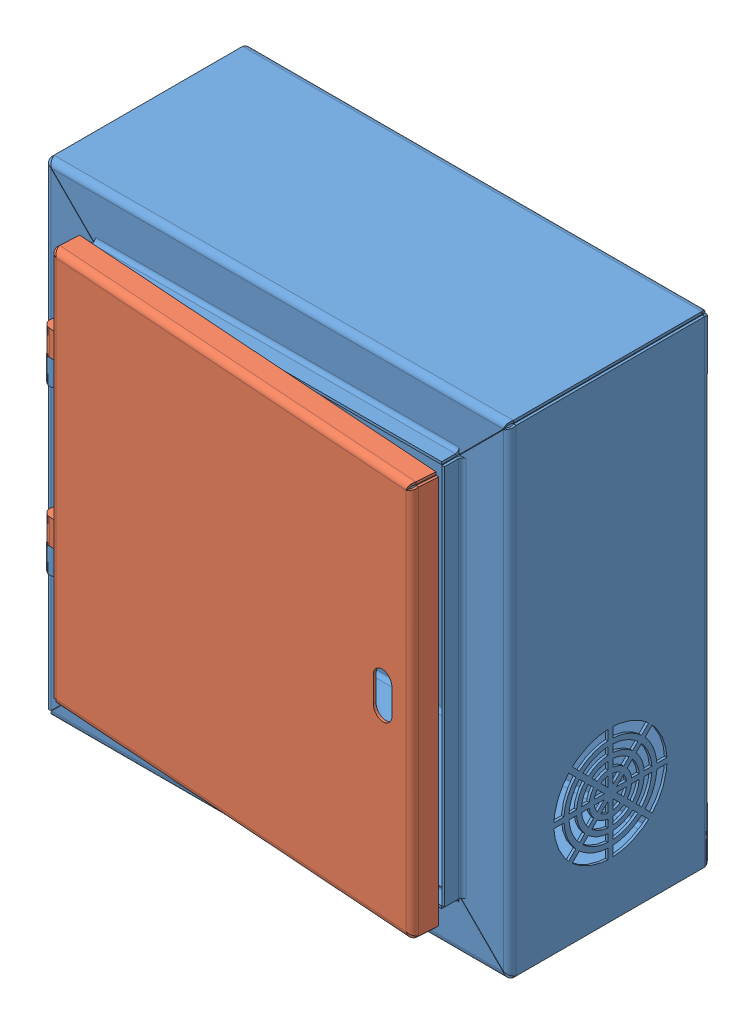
SolidWorks assembly Assem2.sldasm, configuration Default (file format 11000). Lengths in mm.
Overall size (185.01 192 103.13).
2 component instances, 2 part files, 2 mates.
Components (placement in the parent):
- ee-1: ee.SLDPRT [Default] at (-31.3812 10.5842 -34.6329) size (185.01 192 88)
- door-1: door.SLDPRT [Default] at (-31.9999 10.5842 62.1019) x (-0.997569 0 -0.06969) z (0.06969 0 -0.997569) size (163 157 10)
Mates (geometry in assembly coordinates):
- Concentric1: concentric: cylinder of ee-1 through (-113.8812 48.5842 50.3671) axis (0 -1 0) radius 1.5; cylinder of door-1 through (-113.8812 48.5842 50.3671) axis (0 -1 0) radius 1.525
- Coincident1: coincident: plane of ee-1 through (-116.8812 46.5842 53.3671) normal (0 1 0); plane of door-1 through (-116.6648 46.5842 47.1653) normal (0 -1 0)
